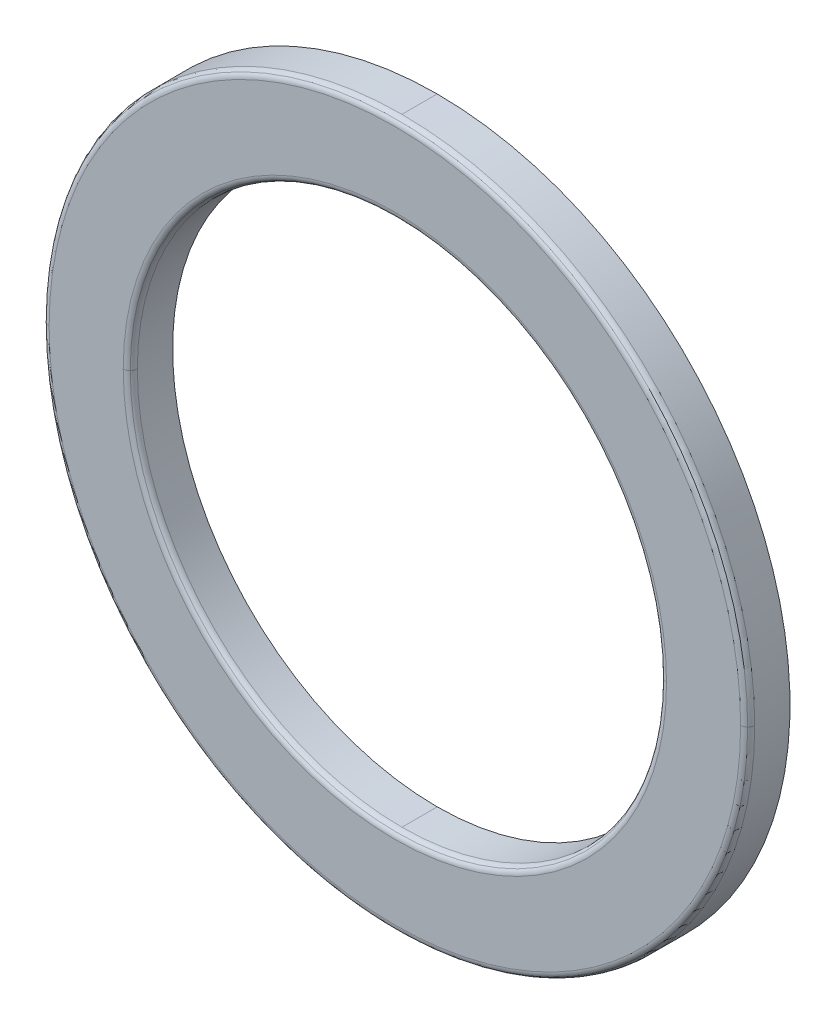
ISO-10303-21;
HEADER;
FILE_DESCRIPTION(('STEP AP214'),'2;1');
FILE_NAME('part.step','',(''),(''),'','','');
FILE_SCHEMA(('AUTOMOTIVE_DESIGN { 1 0 10303 214 1 1 1 1 }'));
ENDSEC;
DATA;
#1=APPLICATION_CONTEXT('core data for automotive mechanical design processes');
#2=APPLICATION_PROTOCOL_DEFINITION('international standard','automotive_design',2000,#1);
#3=PRODUCT_CONTEXT('',#1,'mechanical');
#4=PRODUCT('Part','Part','',(#3));
#5=PRODUCT_RELATED_PRODUCT_CATEGORY('part','',(#4));
#6=PRODUCT_DEFINITION_FORMATION('','',#4);
#7=PRODUCT_DEFINITION_CONTEXT('part definition',#1,'design');
#8=PRODUCT_DEFINITION('design','',#6,#7);
#9=PRODUCT_DEFINITION_SHAPE('','',#8);
#10=(LENGTH_UNIT() NAMED_UNIT(*) SI_UNIT(.MILLI.,.METRE.));
#11=(NAMED_UNIT(*) PLANE_ANGLE_UNIT() SI_UNIT($,.RADIAN.));
#12=(NAMED_UNIT(*) SI_UNIT($,.STERADIAN.) SOLID_ANGLE_UNIT());
#13=UNCERTAINTY_MEASURE_WITH_UNIT(LENGTH_MEASURE(1.E-05),#10,'distance_accuracy_value','');
#14=(GEOMETRIC_REPRESENTATION_CONTEXT(3) GLOBAL_UNCERTAINTY_ASSIGNED_CONTEXT((#13)) GLOBAL_UNIT_ASSIGNED_CONTEXT((#10,
#11,#12)) REPRESENTATION_CONTEXT('',''));
#15=CARTESIAN_POINT('',(0.,0.,0.));
#16=DIRECTION('',(0.,0.,1.));
#17=DIRECTION('',(1.,0.,0.));
#18=AXIS2_PLACEMENT_3D('',#15,#16,#17);
#19=CARTESIAN_POINT('',(0.,0.,-0.999999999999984));
#20=DIRECTION('',(0.,0.,-1.));
#21=DIRECTION('',(-1.,0.,0.));
#22=AXIS2_PLACEMENT_3D('',#19,#20,#21);
#23=TOROIDAL_SURFACE('',#22,38.5,0.999999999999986);
#24=CARTESIAN_POINT('',(-38.5,0.,-0.999999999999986));
#25=DIRECTION('',(0.,-1.,0.));
#26=DIRECTION('',(0.707106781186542,0.,0.707106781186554));
#27=AXIS2_PLACEMENT_3D('',#24,#25,#26);
#28=CIRCLE('',#27,0.999999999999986);
#29=CARTESIAN_POINT('',(-37.7928932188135,0.,-0.292893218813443));
#30=VERTEX_POINT('',#29);
#31=CARTESIAN_POINT('',(-38.5,0.,0.));
#32=VERTEX_POINT('',#31);
#33=EDGE_CURVE('E25',#30,#32,#28,.T.);
#34=ORIENTED_EDGE('',*,*,#33,.F.);
#35=CARTESIAN_POINT('',(0.,0.,-0.292893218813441));
#36=DIRECTION('',(0.,0.,-1.));
#37=DIRECTION('',(-1.,0.,0.));
#38=AXIS2_PLACEMENT_3D('',#35,#36,#37);
#39=CIRCLE('',#38,37.7928932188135);
#40=CARTESIAN_POINT('',(37.7928932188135,0.,-0.292893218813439));
#41=VERTEX_POINT('',#40);
#42=EDGE_CURVE('E20',#30,#41,#39,.T.);
#43=ORIENTED_EDGE('',*,*,#42,.T.);
#44=CARTESIAN_POINT('',(38.5,0.,-0.999999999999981));
#45=DIRECTION('',(0.,1.,0.));
#46=DIRECTION('',(-0.707106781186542,0.,0.707106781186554));
#47=AXIS2_PLACEMENT_3D('',#44,#45,#46);
#48=CIRCLE('',#47,0.999999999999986);
#49=CARTESIAN_POINT('',(38.5,0.,0.));
#50=VERTEX_POINT('',#49);
#51=EDGE_CURVE('E11',#41,#50,#48,.T.);
#52=ORIENTED_EDGE('',*,*,#51,.T.);
#53=CARTESIAN_POINT('',(0.,0.,0.));
#54=DIRECTION('',(0.,0.,-1.));
#55=DIRECTION('',(0.,1.,0.));
#56=AXIS2_PLACEMENT_3D('',#53,#54,#55);
#57=CIRCLE('',#56,38.5);
#58=CARTESIAN_POINT('',(0.,38.5,0.));
#59=VERTEX_POINT('',#58);
#60=EDGE_CURVE('E39',#59,#50,#57,.T.);
#61=ORIENTED_EDGE('',*,*,#60,.F.);
#62=CARTESIAN_POINT('',(0.,0.,0.));
#63=DIRECTION('',(0.,0.,-1.));
#64=DIRECTION('',(-1.,0.,0.));
#65=AXIS2_PLACEMENT_3D('',#62,#63,#64);
#66=CIRCLE('',#65,38.5);
#67=EDGE_CURVE('E267',#32,#59,#66,.T.);
#68=ORIENTED_EDGE('',*,*,#67,.F.);
#69=EDGE_LOOP('',(#34,#43,#52,#61,#68));
#70=FACE_BOUND('',#69,.T.);
#71=ADVANCED_FACE('F17',(#70),#23,.T.);
#72=CARTESIAN_POINT('',(0.,0.,-0.999999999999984));
#73=DIRECTION('',(0.,0.,-1.));
#74=DIRECTION('',(-1.,0.,0.));
#75=AXIS2_PLACEMENT_3D('',#72,#73,#74);
#76=TOROIDAL_SURFACE('',#75,38.5,0.999999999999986);
#77=CARTESIAN_POINT('',(0.,0.,0.));
#78=DIRECTION('',(0.,0.,-1.));
#79=DIRECTION('',(1.,0.,0.));
#80=AXIS2_PLACEMENT_3D('',#77,#78,#79);
#81=CIRCLE('',#80,38.5);
#82=CARTESIAN_POINT('',(0.,-38.5,0.));
#83=VERTEX_POINT('',#82);
#84=EDGE_CURVE('E171',#50,#83,#81,.T.);
#85=ORIENTED_EDGE('',*,*,#84,.F.);
#86=ORIENTED_EDGE('',*,*,#51,.F.);
#87=CARTESIAN_POINT('',(0.,0.,-0.292893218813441));
#88=DIRECTION('',(0.,0.,-1.));
#89=DIRECTION('',(1.,0.,0.));
#90=AXIS2_PLACEMENT_3D('',#87,#88,#89);
#91=CIRCLE('',#90,37.7928932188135);
#92=EDGE_CURVE('E247',#41,#30,#91,.T.);
#93=ORIENTED_EDGE('',*,*,#92,.T.);
#94=ORIENTED_EDGE('',*,*,#33,.T.);
#95=CARTESIAN_POINT('',(0.,0.,0.));
#96=DIRECTION('',(0.,0.,-1.));
#97=DIRECTION('',(0.,-1.,0.));
#98=AXIS2_PLACEMENT_3D('',#95,#96,#97);
#99=CIRCLE('',#98,38.5);
#100=EDGE_CURVE('E32',#83,#32,#99,.T.);
#101=ORIENTED_EDGE('',*,*,#100,.F.);
#102=EDGE_LOOP('',(#85,#86,#93,#94,#101));
#103=FACE_BOUND('',#102,.T.);
#104=ADVANCED_FACE('F258',(#103),#76,.T.);
#105=CARTESIAN_POINT('',(0.,0.,-0.999999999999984));
#106=DIRECTION('',(0.,0.,-1.));
#107=DIRECTION('',(-1.,0.,0.));
#108=AXIS2_PLACEMENT_3D('',#105,#106,#107);
#109=TOROIDAL_SURFACE('',#108,38.5,0.999999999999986);
#110=CARTESIAN_POINT('',(0.,0.,-0.999999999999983));
#111=DIRECTION('',(0.,0.,-1.));
#112=DIRECTION('',(0.,-1.,0.));
#113=AXIS2_PLACEMENT_3D('',#110,#111,#112);
#114=CIRCLE('',#113,37.5);
#115=CARTESIAN_POINT('',(0.,-37.5,-0.999999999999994));
#116=VERTEX_POINT('',#115);
#117=CARTESIAN_POINT('',(-37.5,0.,-0.999999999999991));
#118=VERTEX_POINT('',#117);
#119=EDGE_CURVE('E238',#116,#118,#114,.T.);
#120=ORIENTED_EDGE('',*,*,#119,.T.);
#121=CARTESIAN_POINT('',(-38.5,0.,-0.999999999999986));
#122=DIRECTION('',(0.,-1.,0.));
#123=DIRECTION('',(1.,0.,0.));
#124=AXIS2_PLACEMENT_3D('',#121,#122,#123);
#125=CIRCLE('',#124,0.999999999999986);
#126=EDGE_CURVE('E242',#118,#30,#125,.T.);
#127=ORIENTED_EDGE('',*,*,#126,.T.);
#128=ORIENTED_EDGE('',*,*,#92,.F.);
#129=CARTESIAN_POINT('',(38.5,0.,-0.999999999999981));
#130=DIRECTION('',(0.,1.,0.));
#131=DIRECTION('',(-1.,0.,0.));
#132=AXIS2_PLACEMENT_3D('',#129,#130,#131);
#133=CIRCLE('',#132,0.999999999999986);
#134=CARTESIAN_POINT('',(37.5,0.,-0.999999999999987));
#135=VERTEX_POINT('',#134);
#136=EDGE_CURVE('E248',#135,#41,#133,.T.);
#137=ORIENTED_EDGE('',*,*,#136,.F.);
#138=CARTESIAN_POINT('',(0.,0.,-0.999999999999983));
#139=DIRECTION('',(0.,0.,-1.));
#140=DIRECTION('',(1.,0.,0.));
#141=AXIS2_PLACEMENT_3D('',#138,#139,#140);
#142=CIRCLE('',#141,37.5);
#143=EDGE_CURVE('E245',#135,#116,#142,.T.);
#144=ORIENTED_EDGE('',*,*,#143,.T.);
#145=EDGE_LOOP('',(#120,#127,#128,#137,#144));
#146=FACE_BOUND('',#145,.T.);
#147=ADVANCED_FACE('F262',(#146),#109,.T.);
#148=CARTESIAN_POINT('',(0.,0.,-3.5));
#149=DIRECTION('',(0.,0.,-1.));
#150=DIRECTION('',(0.,1.,0.));
#151=AXIS2_PLACEMENT_3D('',#148,#149,#150);
#152=CYLINDRICAL_SURFACE('',#151,37.5);
#153=CARTESIAN_POINT('',(0.,0.,-0.999999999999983));
#154=DIRECTION('',(0.,0.,-1.));
#155=DIRECTION('',(0.,1.,0.));
#156=AXIS2_PLACEMENT_3D('',#153,#154,#155);
#157=CIRCLE('',#156,37.5);
#158=CARTESIAN_POINT('',(0.,37.5,-0.999999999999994));
#159=VERTEX_POINT('',#158);
#160=EDGE_CURVE('E239',#159,#135,#157,.T.);
#161=ORIENTED_EDGE('',*,*,#160,.F.);
#162=DIRECTION('',(0.,0.,-1.));
#163=VECTOR('',#162,1.);
#164=CARTESIAN_POINT('',(0.,37.5,-1.));
#165=LINE('',#164,#163);
#166=CARTESIAN_POINT('',(0.,37.5,-6.));
#167=VERTEX_POINT('',#166);
#168=EDGE_CURVE('E233',#159,#167,#165,.T.);
#169=ORIENTED_EDGE('',*,*,#168,.T.);
#170=CARTESIAN_POINT('',(0.,0.,-6.00000000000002));
#171=DIRECTION('',(0.,0.,1.));
#172=DIRECTION('',(0.,-1.,0.));
#173=AXIS2_PLACEMENT_3D('',#170,#171,#172);
#174=CIRCLE('',#173,37.5);
#175=CARTESIAN_POINT('',(0.,-37.5,-6.00000000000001));
#176=VERTEX_POINT('',#175);
#177=EDGE_CURVE('E229',#176,#167,#174,.T.);
#178=ORIENTED_EDGE('',*,*,#177,.F.);
#179=DIRECTION('',(0.,0.,-1.));
#180=VECTOR('',#179,1.);
#181=CARTESIAN_POINT('',(0.,-37.5,-1.));
#182=LINE('',#181,#180);
#183=EDGE_CURVE('E235',#116,#176,#182,.T.);
#184=ORIENTED_EDGE('',*,*,#183,.F.);
#185=ORIENTED_EDGE('',*,*,#143,.F.);
#186=EDGE_LOOP('',(#161,#169,#178,#184,#185));
#187=FACE_BOUND('',#186,.T.);
#188=ADVANCED_FACE('F289',(#187),#152,.F.);
#189=CARTESIAN_POINT('',(0.,0.,-0.999999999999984));
#190=DIRECTION('',(0.,0.,-1.));
#191=DIRECTION('',(-1.,0.,0.));
#192=AXIS2_PLACEMENT_3D('',#189,#190,#191);
#193=TOROIDAL_SURFACE('',#192,38.5,0.999999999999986);
#194=ORIENTED_EDGE('',*,*,#136,.T.);
#195=ORIENTED_EDGE('',*,*,#42,.F.);
#196=ORIENTED_EDGE('',*,*,#126,.F.);
#197=CARTESIAN_POINT('',(0.,0.,-0.999999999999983));
#198=DIRECTION('',(0.,0.,-1.));
#199=DIRECTION('',(-1.,0.,0.));
#200=AXIS2_PLACEMENT_3D('',#197,#198,#199);
#201=CIRCLE('',#200,37.5);
#202=EDGE_CURVE('E232',#118,#159,#201,.T.);
#203=ORIENTED_EDGE('',*,*,#202,.T.);
#204=ORIENTED_EDGE('',*,*,#160,.T.);
#205=EDGE_LOOP('',(#194,#195,#196,#203,#204));
#206=FACE_BOUND('',#205,.T.);
#207=ADVANCED_FACE('F266',(#206),#193,.T.);
#208=CARTESIAN_POINT('',(0.,0.,-3.5));
#209=DIRECTION('',(0.,0.,-1.));
#210=DIRECTION('',(0.,1.,0.));
#211=AXIS2_PLACEMENT_3D('',#208,#209,#210);
#212=CYLINDRICAL_SURFACE('',#211,37.5);
#213=ORIENTED_EDGE('',*,*,#119,.F.);
#214=ORIENTED_EDGE('',*,*,#183,.T.);
#215=CARTESIAN_POINT('',(0.,0.,-6.00000000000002));
#216=DIRECTION('',(0.,0.,1.));
#217=DIRECTION('',(0.,1.,0.));
#218=AXIS2_PLACEMENT_3D('',#215,#216,#217);
#219=CIRCLE('',#218,37.5);
#220=EDGE_CURVE('E223',#167,#176,#219,.T.);
#221=ORIENTED_EDGE('',*,*,#220,.F.);
#222=ORIENTED_EDGE('',*,*,#168,.F.);
#223=ORIENTED_EDGE('',*,*,#202,.F.);
#224=EDGE_LOOP('',(#213,#214,#221,#222,#223));
#225=FACE_BOUND('',#224,.T.);
#226=ADVANCED_FACE('F297',(#225),#212,.F.);
#227=CARTESIAN_POINT('',(0.,0.,-9.49949999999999));
#228=DIRECTION('',(0.,0.,-1.));
#229=DIRECTION('',(-1.,0.,0.));
#230=AXIS2_PLACEMENT_3D('',#227,#228,#229);
#231=TOROIDAL_SURFACE('',#230,43.75,4.36549999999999);
#232=CARTESIAN_POINT('',(-43.75,0.,-9.49949999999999));
#233=DIRECTION('',(0.,-1.,0.));
#234=DIRECTION('',(0.597825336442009,0.,0.801626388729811));
#235=AXIS2_PLACEMENT_3D('',#232,#233,#234);
#236=CIRCLE('',#235,4.36549999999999);
#237=CARTESIAN_POINT('',(-41.1401934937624,0.,-6.00000000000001));
#238=VERTEX_POINT('',#237);
#239=CARTESIAN_POINT('',(-43.75,0.,-5.134));
#240=VERTEX_POINT('',#239);
#241=EDGE_CURVE('E211',#238,#240,#236,.T.);
#242=ORIENTED_EDGE('',*,*,#241,.T.);
#243=CARTESIAN_POINT('',(0.,0.,-5.13399999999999));
#244=DIRECTION('',(0.,0.,-1.));
#245=DIRECTION('',(-1.,0.,0.));
#246=AXIS2_PLACEMENT_3D('',#243,#244,#245);
#247=CIRCLE('',#246,43.75);
#248=CARTESIAN_POINT('',(43.75,0.,-5.13399999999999));
#249=VERTEX_POINT('',#248);
#250=EDGE_CURVE('E201',#240,#249,#247,.T.);
#251=ORIENTED_EDGE('',*,*,#250,.T.);
#252=CARTESIAN_POINT('',(43.75,0.,-9.49949999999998));
#253=DIRECTION('',(0.,1.,0.));
#254=DIRECTION('',(-0.597825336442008,0.,0.801626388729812));
#255=AXIS2_PLACEMENT_3D('',#252,#253,#254);
#256=CIRCLE('',#255,4.36549999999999);
#257=CARTESIAN_POINT('',(41.1401934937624,0.,-6.));
#258=VERTEX_POINT('',#257);
#259=EDGE_CURVE('E213',#258,#249,#256,.T.);
#260=ORIENTED_EDGE('',*,*,#259,.F.);
#261=CARTESIAN_POINT('',(0.,0.,-6.00000000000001));
#262=DIRECTION('',(0.,0.,-1.));
#263=DIRECTION('',(0.,1.,0.));
#264=AXIS2_PLACEMENT_3D('',#261,#262,#263);
#265=CIRCLE('',#264,41.1401934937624);
#266=CARTESIAN_POINT('',(0.,41.1401934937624,-6.));
#267=VERTEX_POINT('',#266);
#268=EDGE_CURVE('E217',#267,#258,#265,.T.);
#269=ORIENTED_EDGE('',*,*,#268,.F.);
#270=CARTESIAN_POINT('',(0.,0.,-6.00000000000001));
#271=DIRECTION('',(0.,0.,-1.));
#272=DIRECTION('',(-1.,0.,0.));
#273=AXIS2_PLACEMENT_3D('',#270,#271,#272);
#274=CIRCLE('',#273,41.1401934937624);
#275=EDGE_CURVE('E220',#238,#267,#274,.T.);
#276=ORIENTED_EDGE('',*,*,#275,.F.);
#277=EDGE_LOOP('',(#242,#251,#260,#269,#276));
#278=FACE_BOUND('',#277,.T.);
#279=ADVANCED_FACE('F300',(#278),#231,.F.);
#280=CARTESIAN_POINT('',(0.,39.3200967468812,-6.));
#281=DIRECTION('',(0.,0.,-1.));
#282=DIRECTION('',(-1.,0.,0.));
#283=AXIS2_PLACEMENT_3D('',#280,#281,#282);
#284=PLANE('',#283);
#285=ORIENTED_EDGE('',*,*,#177,.T.);
#286=ORIENTED_EDGE('',*,*,#220,.T.);
#287=EDGE_LOOP('',(#285,#286));
#288=FACE_BOUND('',#287,.T.);
#289=CARTESIAN_POINT('',(0.,0.,-6.00000000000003));
#290=DIRECTION('',(0.,0.,-1.));
#291=DIRECTION('',(1.,0.,0.));
#292=AXIS2_PLACEMENT_3D('',#289,#290,#291);
#293=CIRCLE('',#292,41.1401934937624);
#294=CARTESIAN_POINT('',(0.,-41.1401934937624,-6.00000000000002));
#295=VERTEX_POINT('',#294);
#296=EDGE_CURVE('E216',#258,#295,#293,.T.);
#297=ORIENTED_EDGE('',*,*,#296,.T.);
#298=CARTESIAN_POINT('',(0.,0.,-6.00000000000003));
#299=DIRECTION('',(0.,0.,-1.));
#300=DIRECTION('',(0.,-1.,0.));
#301=AXIS2_PLACEMENT_3D('',#298,#299,#300);
#302=CIRCLE('',#301,41.1401934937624);
#303=EDGE_CURVE('E208',#295,#238,#302,.T.);
#304=ORIENTED_EDGE('',*,*,#303,.T.);
#305=ORIENTED_EDGE('',*,*,#275,.T.);
#306=ORIENTED_EDGE('',*,*,#268,.T.);
#307=EDGE_LOOP('',(#297,#304,#305,#306));
#308=FACE_BOUND('',#307,.T.);
#309=ADVANCED_FACE('F304',(#288,#308),#284,.T.);
#310=CARTESIAN_POINT('',(0.,0.,-9.49949999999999));
#311=DIRECTION('',(0.,0.,-1.));
#312=DIRECTION('',(-1.,0.,0.));
#313=AXIS2_PLACEMENT_3D('',#310,#311,#312);
#314=TOROIDAL_SURFACE('',#313,43.75,4.36549999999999);
#315=ORIENTED_EDGE('',*,*,#296,.F.);
#316=ORIENTED_EDGE('',*,*,#259,.T.);
#317=CARTESIAN_POINT('',(0.,0.,-5.13399999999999));
#318=DIRECTION('',(0.,0.,-1.));
#319=DIRECTION('',(1.,0.,0.));
#320=AXIS2_PLACEMENT_3D('',#317,#318,#319);
#321=CIRCLE('',#320,43.75);
#322=EDGE_CURVE('E205',#249,#240,#321,.T.);
#323=ORIENTED_EDGE('',*,*,#322,.T.);
#324=ORIENTED_EDGE('',*,*,#241,.F.);
#325=ORIENTED_EDGE('',*,*,#303,.F.);
#326=EDGE_LOOP('',(#315,#316,#323,#324,#325));
#327=FACE_BOUND('',#326,.T.);
#328=ADVANCED_FACE('F308',(#327),#314,.F.);
#329=CARTESIAN_POINT('',(0.,0.,-9.49949999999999));
#330=DIRECTION('',(0.,0.,-1.));
#331=DIRECTION('',(-1.,0.,0.));
#332=AXIS2_PLACEMENT_3D('',#329,#330,#331);
#333=TOROIDAL_SURFACE('',#332,43.75,4.36549999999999);
#334=CARTESIAN_POINT('',(-43.75,0.,-9.49949999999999));
#335=DIRECTION('',(0.,-1.,0.));
#336=DIRECTION('',(0.,0.,1.));
#337=AXIS2_PLACEMENT_3D('',#334,#335,#336);
#338=CIRCLE('',#337,4.36549999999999);
#339=CARTESIAN_POINT('',(-46.3598065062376,0.,-6.));
#340=VERTEX_POINT('',#339);
#341=EDGE_CURVE('E199',#240,#340,#338,.T.);
#342=ORIENTED_EDGE('',*,*,#341,.F.);
#343=ORIENTED_EDGE('',*,*,#322,.F.);
#344=CARTESIAN_POINT('',(43.75,0.,-9.49949999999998));
#345=DIRECTION('',(0.,1.,0.));
#346=DIRECTION('',(0.,0.,1.));
#347=AXIS2_PLACEMENT_3D('',#344,#345,#346);
#348=CIRCLE('',#347,4.36549999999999);
#349=CARTESIAN_POINT('',(46.3598065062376,0.,-5.99999999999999));
#350=VERTEX_POINT('',#349);
#351=EDGE_CURVE('E203',#249,#350,#348,.T.);
#352=ORIENTED_EDGE('',*,*,#351,.T.);
#353=CARTESIAN_POINT('',(0.,0.,-5.99999999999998));
#354=DIRECTION('',(0.,0.,1.));
#355=DIRECTION('',(-1.,0.,0.));
#356=AXIS2_PLACEMENT_3D('',#353,#354,#355);
#357=CIRCLE('',#356,46.3598065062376);
#358=EDGE_CURVE('E194',#340,#350,#357,.T.);
#359=ORIENTED_EDGE('',*,*,#358,.F.);
#360=EDGE_LOOP('',(#342,#343,#352,#359));
#361=FACE_BOUND('',#360,.T.);
#362=ADVANCED_FACE('F312',(#361),#333,.F.);
#363=CARTESIAN_POINT('',(0.,0.,-9.49949999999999));
#364=DIRECTION('',(0.,0.,-1.));
#365=DIRECTION('',(-1.,0.,0.));
#366=AXIS2_PLACEMENT_3D('',#363,#364,#365);
#367=TOROIDAL_SURFACE('',#366,43.75,4.36549999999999);
#368=ORIENTED_EDGE('',*,*,#351,.F.);
#369=ORIENTED_EDGE('',*,*,#250,.F.);
#370=ORIENTED_EDGE('',*,*,#341,.T.);
#371=CARTESIAN_POINT('',(0.,0.,-6.));
#372=DIRECTION('',(0.,0.,1.));
#373=DIRECTION('',(0.,1.,0.));
#374=AXIS2_PLACEMENT_3D('',#371,#372,#373);
#375=CIRCLE('',#374,46.3598065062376);
#376=CARTESIAN_POINT('',(0.,46.3598065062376,-6.));
#377=VERTEX_POINT('',#376);
#378=EDGE_CURVE('E186',#377,#340,#375,.T.);
#379=ORIENTED_EDGE('',*,*,#378,.F.);
#380=CARTESIAN_POINT('',(0.,0.,-5.99999999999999));
#381=DIRECTION('',(0.,0.,1.));
#382=DIRECTION('',(1.,0.,0.));
#383=AXIS2_PLACEMENT_3D('',#380,#381,#382);
#384=CIRCLE('',#383,46.3598065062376);
#385=EDGE_CURVE('E191',#350,#377,#384,.T.);
#386=ORIENTED_EDGE('',*,*,#385,.F.);
#387=EDGE_LOOP('',(#368,#369,#370,#379,#386));
#388=FACE_BOUND('',#387,.T.);
#389=ADVANCED_FACE('F316',(#388),#367,.F.);
#390=CARTESIAN_POINT('',(0.,0.,-0.999999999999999));
#391=DIRECTION('',(0.,0.,-1.));
#392=DIRECTION('',(-1.,0.,0.));
#393=AXIS2_PLACEMENT_3D('',#390,#391,#392);
#394=TOROIDAL_SURFACE('',#393,49.,0.999999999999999);
#395=CARTESIAN_POINT('',(-49.,0.,-1.));
#396=DIRECTION('',(0.,-1.,0.));
#397=DIRECTION('',(-0.707106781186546,0.,0.707106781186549));
#398=AXIS2_PLACEMENT_3D('',#395,#396,#397);
#399=CIRCLE('',#398,0.999999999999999);
#400=CARTESIAN_POINT('',(-49.7071067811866,0.,-0.292893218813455));
#401=VERTEX_POINT('',#400);
#402=CARTESIAN_POINT('',(-50.,0.,-1.));
#403=VERTEX_POINT('',#402);
#404=EDGE_CURVE('E164',#401,#403,#399,.T.);
#405=ORIENTED_EDGE('',*,*,#404,.F.);
#406=CARTESIAN_POINT('',(0.,0.,-0.292893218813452));
#407=DIRECTION('',(0.,0.,-1.));
#408=DIRECTION('',(-1.,0.,0.));
#409=AXIS2_PLACEMENT_3D('',#406,#407,#408);
#410=CIRCLE('',#409,49.7071067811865);
#411=CARTESIAN_POINT('',(49.7071067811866,0.,-0.292893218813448));
#412=VERTEX_POINT('',#411);
#413=EDGE_CURVE('E154',#401,#412,#410,.T.);
#414=ORIENTED_EDGE('',*,*,#413,.T.);
#415=CARTESIAN_POINT('',(49.,0.,-0.999999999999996));
#416=DIRECTION('',(0.,1.,0.));
#417=DIRECTION('',(0.707106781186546,0.,0.707106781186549));
#418=AXIS2_PLACEMENT_3D('',#415,#416,#417);
#419=CIRCLE('',#418,0.999999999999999);
#420=CARTESIAN_POINT('',(50.,0.,-0.999999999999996));
#421=VERTEX_POINT('',#420);
#422=EDGE_CURVE('E168',#412,#421,#419,.T.);
#423=ORIENTED_EDGE('',*,*,#422,.T.);
#424=CARTESIAN_POINT('',(0.,0.,-0.999999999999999));
#425=DIRECTION('',(0.,0.,1.));
#426=DIRECTION('',(1.,0.,0.));
#427=AXIS2_PLACEMENT_3D('',#424,#425,#426);
#428=CIRCLE('',#427,50.);
#429=CARTESIAN_POINT('',(0.,50.,-1.));
#430=VERTEX_POINT('',#429);
#431=EDGE_CURVE('E197',#421,#430,#428,.T.);
#432=ORIENTED_EDGE('',*,*,#431,.T.);
#433=CARTESIAN_POINT('',(0.,0.,-0.999999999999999));
#434=DIRECTION('',(0.,0.,1.));
#435=DIRECTION('',(0.,1.,0.));
#436=AXIS2_PLACEMENT_3D('',#433,#434,#435);
#437=CIRCLE('',#436,50.);
#438=EDGE_CURVE('E180',#430,#403,#437,.T.);
#439=ORIENTED_EDGE('',*,*,#438,.T.);
#440=EDGE_LOOP('',(#405,#414,#423,#432,#439));
#441=FACE_BOUND('',#440,.T.);
#442=ADVANCED_FACE('F320',(#441),#394,.T.);
#443=CARTESIAN_POINT('',(0.,0.,-3.5));
#444=DIRECTION('',(0.,0.,-1.));
#445=DIRECTION('',(0.,1.,0.));
#446=AXIS2_PLACEMENT_3D('',#443,#444,#445);
#447=CYLINDRICAL_SURFACE('',#446,50.);
#448=DIRECTION('',(0.,0.,-1.));
#449=VECTOR('',#448,1.);
#450=CARTESIAN_POINT('',(0.,50.,-1.));
#451=LINE('',#450,#449);
#452=CARTESIAN_POINT('',(0.,50.,-6.));
#453=VERTEX_POINT('',#452);
#454=EDGE_CURVE('E177',#430,#453,#451,.T.);
#455=ORIENTED_EDGE('',*,*,#454,.F.);
#456=ORIENTED_EDGE('',*,*,#431,.F.);
#457=CARTESIAN_POINT('',(0.,0.,-0.999999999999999));
#458=DIRECTION('',(0.,0.,1.));
#459=DIRECTION('',(0.,-1.,0.));
#460=AXIS2_PLACEMENT_3D('',#457,#458,#459);
#461=CIRCLE('',#460,50.);
#462=CARTESIAN_POINT('',(0.,-50.,-1.));
#463=VERTEX_POINT('',#462);
#464=EDGE_CURVE('E173',#463,#421,#461,.T.);
#465=ORIENTED_EDGE('',*,*,#464,.F.);
#466=DIRECTION('',(0.,0.,-1.));
#467=VECTOR('',#466,1.);
#468=CARTESIAN_POINT('',(0.,-50.,-1.));
#469=LINE('',#468,#467);
#470=CARTESIAN_POINT('',(0.,-50.,-5.99999999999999));
#471=VERTEX_POINT('',#470);
#472=EDGE_CURVE('E181',#463,#471,#469,.T.);
#473=ORIENTED_EDGE('',*,*,#472,.T.);
#474=CARTESIAN_POINT('',(0.,0.,-5.99999999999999));
#475=DIRECTION('',(0.,0.,-1.));
#476=DIRECTION('',(0.,1.,0.));
#477=AXIS2_PLACEMENT_3D('',#474,#475,#476);
#478=CIRCLE('',#477,50.);
#479=EDGE_CURVE('E183',#453,#471,#478,.T.);
#480=ORIENTED_EDGE('',*,*,#479,.F.);
#481=EDGE_LOOP('',(#455,#456,#465,#473,#480));
#482=FACE_BOUND('',#481,.T.);
#483=ADVANCED_FACE('F324',(#482),#447,.T.);
#484=CARTESIAN_POINT('',(0.,48.1799032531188,-6.));
#485=DIRECTION('',(0.,0.,-1.));
#486=DIRECTION('',(-1.,0.,0.));
#487=AXIS2_PLACEMENT_3D('',#484,#485,#486);
#488=PLANE('',#487);
#489=ORIENTED_EDGE('',*,*,#358,.T.);
#490=ORIENTED_EDGE('',*,*,#385,.T.);
#491=ORIENTED_EDGE('',*,*,#378,.T.);
#492=EDGE_LOOP('',(#489,#490,#491));
#493=FACE_BOUND('',#492,.T.);
#494=CARTESIAN_POINT('',(0.,0.,-5.99999999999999));
#495=DIRECTION('',(0.,0.,-1.));
#496=DIRECTION('',(0.,-1.,0.));
#497=AXIS2_PLACEMENT_3D('',#494,#495,#496);
#498=CIRCLE('',#497,50.);
#499=EDGE_CURVE('E176',#471,#453,#498,.T.);
#500=ORIENTED_EDGE('',*,*,#499,.T.);
#501=ORIENTED_EDGE('',*,*,#479,.T.);
#502=EDGE_LOOP('',(#500,#501));
#503=FACE_BOUND('',#502,.T.);
#504=ADVANCED_FACE('F328',(#493,#503),#488,.T.);
#505=CARTESIAN_POINT('',(0.,0.,-3.5));
#506=DIRECTION('',(0.,0.,-1.));
#507=DIRECTION('',(0.,1.,0.));
#508=AXIS2_PLACEMENT_3D('',#505,#506,#507);
#509=CYLINDRICAL_SURFACE('',#508,50.);
#510=ORIENTED_EDGE('',*,*,#472,.F.);
#511=CARTESIAN_POINT('',(0.,0.,-0.999999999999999));
#512=DIRECTION('',(0.,0.,1.));
#513=DIRECTION('',(-1.,0.,0.));
#514=AXIS2_PLACEMENT_3D('',#511,#512,#513);
#515=CIRCLE('',#514,50.);
#516=EDGE_CURVE('E161',#403,#463,#515,.T.);
#517=ORIENTED_EDGE('',*,*,#516,.F.);
#518=ORIENTED_EDGE('',*,*,#438,.F.);
#519=ORIENTED_EDGE('',*,*,#454,.T.);
#520=ORIENTED_EDGE('',*,*,#499,.F.);
#521=EDGE_LOOP('',(#510,#517,#518,#519,#520));
#522=FACE_BOUND('',#521,.T.);
#523=ADVANCED_FACE('F332',(#522),#509,.T.);
#524=CARTESIAN_POINT('',(0.,0.,-0.999999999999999));
#525=DIRECTION('',(0.,0.,-1.));
#526=DIRECTION('',(-1.,0.,0.));
#527=AXIS2_PLACEMENT_3D('',#524,#525,#526);
#528=TOROIDAL_SURFACE('',#527,49.,0.999999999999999);
#529=ORIENTED_EDGE('',*,*,#464,.T.);
#530=ORIENTED_EDGE('',*,*,#422,.F.);
#531=CARTESIAN_POINT('',(0.,0.,-0.292893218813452));
#532=DIRECTION('',(0.,0.,-1.));
#533=DIRECTION('',(1.,0.,0.));
#534=AXIS2_PLACEMENT_3D('',#531,#532,#533);
#535=CIRCLE('',#534,49.7071067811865);
#536=EDGE_CURVE('E165',#412,#401,#535,.T.);
#537=ORIENTED_EDGE('',*,*,#536,.T.);
#538=ORIENTED_EDGE('',*,*,#404,.T.);
#539=ORIENTED_EDGE('',*,*,#516,.T.);
#540=EDGE_LOOP('',(#529,#530,#537,#538,#539));
#541=FACE_BOUND('',#540,.T.);
#542=ADVANCED_FACE('F280',(#541),#528,.T.);
#543=CARTESIAN_POINT('',(0.,0.,-0.999999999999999));
#544=DIRECTION('',(0.,0.,-1.));
#545=DIRECTION('',(-1.,0.,0.));
#546=AXIS2_PLACEMENT_3D('',#543,#544,#545);
#547=TOROIDAL_SURFACE('',#546,49.,0.999999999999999);
#548=CARTESIAN_POINT('',(0.,0.,0.));
#549=DIRECTION('',(0.,0.,1.));
#550=DIRECTION('',(-1.,0.,0.));
#551=AXIS2_PLACEMENT_3D('',#548,#549,#550);
#552=CIRCLE('',#551,49.);
#553=CARTESIAN_POINT('',(-49.,0.,0.));
#554=VERTEX_POINT('',#553);
#555=CARTESIAN_POINT('',(0.,-49.,0.));
#556=VERTEX_POINT('',#555);
#557=EDGE_CURVE('E134',#554,#556,#552,.T.);
#558=ORIENTED_EDGE('',*,*,#557,.F.);
#559=CARTESIAN_POINT('',(-49.,0.,-1.));
#560=DIRECTION('',(0.,-1.,0.));
#561=DIRECTION('',(0.,0.,1.));
#562=AXIS2_PLACEMENT_3D('',#559,#560,#561);
#563=CIRCLE('',#562,0.999999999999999);
#564=EDGE_CURVE('E139',#554,#401,#563,.T.);
#565=ORIENTED_EDGE('',*,*,#564,.T.);
#566=ORIENTED_EDGE('',*,*,#536,.F.);
#567=CARTESIAN_POINT('',(49.,0.,-0.999999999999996));
#568=DIRECTION('',(0.,1.,0.));
#569=DIRECTION('',(0.,0.,1.));
#570=AXIS2_PLACEMENT_3D('',#567,#568,#569);
#571=CIRCLE('',#570,0.999999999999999);
#572=CARTESIAN_POINT('',(49.,0.,0.));
#573=VERTEX_POINT('',#572);
#574=EDGE_CURVE('E156',#573,#412,#571,.T.);
#575=ORIENTED_EDGE('',*,*,#574,.F.);
#576=CARTESIAN_POINT('',(0.,0.,0.));
#577=DIRECTION('',(0.,0.,1.));
#578=DIRECTION('',(0.,-1.,0.));
#579=AXIS2_PLACEMENT_3D('',#576,#577,#578);
#580=CIRCLE('',#579,49.);
#581=EDGE_CURVE('E142',#556,#573,#580,.T.);
#582=ORIENTED_EDGE('',*,*,#581,.F.);
#583=EDGE_LOOP('',(#558,#565,#566,#575,#582));
#584=FACE_BOUND('',#583,.T.);
#585=ADVANCED_FACE('F136',(#584),#547,.T.);
#586=CARTESIAN_POINT('',(0.,43.75,0.));
#587=DIRECTION('',(0.,0.,1.));
#588=DIRECTION('',(1.,0.,0.));
#589=AXIS2_PLACEMENT_3D('',#586,#587,#588);
#590=PLANE('',#589);
#591=ORIENTED_EDGE('',*,*,#84,.T.);
#592=ORIENTED_EDGE('',*,*,#100,.T.);
#593=ORIENTED_EDGE('',*,*,#67,.T.);
#594=ORIENTED_EDGE('',*,*,#60,.T.);
#595=EDGE_LOOP('',(#591,#592,#593,#594));
#596=FACE_BOUND('',#595,.T.);
#597=ORIENTED_EDGE('',*,*,#557,.T.);
#598=ORIENTED_EDGE('',*,*,#581,.T.);
#599=CARTESIAN_POINT('',(0.,0.,0.));
#600=DIRECTION('',(0.,0.,1.));
#601=DIRECTION('',(1.,0.,0.));
#602=AXIS2_PLACEMENT_3D('',#599,#600,#601);
#603=CIRCLE('',#602,49.);
#604=CARTESIAN_POINT('',(0.,49.,0.));
#605=VERTEX_POINT('',#604);
#606=EDGE_CURVE('E149',#573,#605,#603,.T.);
#607=ORIENTED_EDGE('',*,*,#606,.T.);
#608=CARTESIAN_POINT('',(0.,0.,0.));
#609=DIRECTION('',(0.,0.,1.));
#610=DIRECTION('',(0.,1.,0.));
#611=AXIS2_PLACEMENT_3D('',#608,#609,#610);
#612=CIRCLE('',#611,49.);
#613=EDGE_CURVE('E146',#605,#554,#612,.T.);
#614=ORIENTED_EDGE('',*,*,#613,.T.);
#615=EDGE_LOOP('',(#597,#598,#607,#614));
#616=FACE_BOUND('',#615,.T.);
#617=ADVANCED_FACE('F147',(#596,#616),#590,.T.);
#618=CARTESIAN_POINT('',(0.,0.,-0.999999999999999));
#619=DIRECTION('',(0.,0.,-1.));
#620=DIRECTION('',(-1.,0.,0.));
#621=AXIS2_PLACEMENT_3D('',#618,#619,#620);
#622=TOROIDAL_SURFACE('',#621,49.,0.999999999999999);
#623=ORIENTED_EDGE('',*,*,#574,.T.);
#624=ORIENTED_EDGE('',*,*,#413,.F.);
#625=ORIENTED_EDGE('',*,*,#564,.F.);
#626=ORIENTED_EDGE('',*,*,#613,.F.);
#627=ORIENTED_EDGE('',*,*,#606,.F.);
#628=EDGE_LOOP('',(#623,#624,#625,#626,#627));
#629=FACE_BOUND('',#628,.T.);
#630=ADVANCED_FACE('F153',(#629),#622,.T.);
#631=CLOSED_SHELL('',(#71,#104,#147,#188,#207,#226,#279,#309,#328,#362,#389,#442,#483,#504,#523,
#542,#585,#617,#630));
#632=MANIFOLD_SOLID_BREP('B1',#631);
#633=ADVANCED_BREP_SHAPE_REPRESENTATION('',(#18,#632),#14);
#634=SHAPE_DEFINITION_REPRESENTATION(#9,#633);
ENDSEC;
END-ISO-10303-21;
